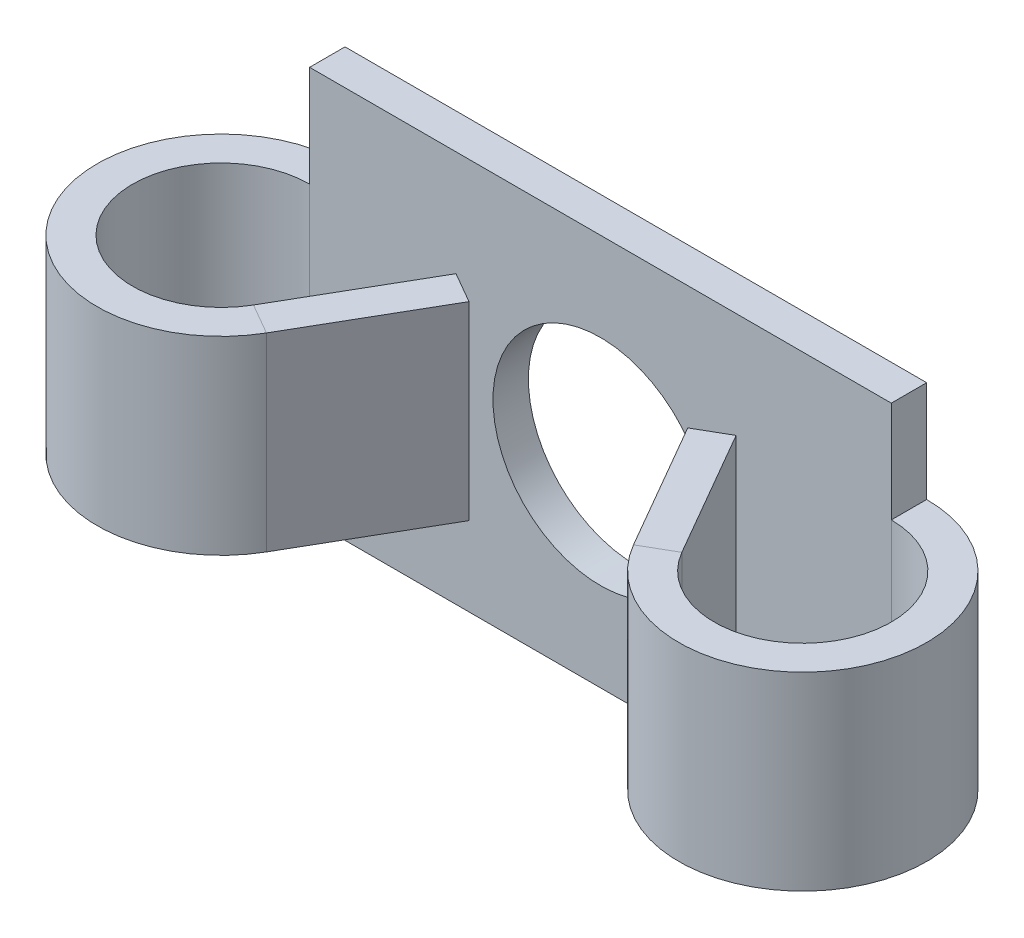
ISO-10303-21;
HEADER;
FILE_DESCRIPTION(('STEP AP214'),'2;1');
FILE_NAME('part.step','',(''),(''),'','','');
FILE_SCHEMA(('AUTOMOTIVE_DESIGN { 1 0 10303 214 1 1 1 1 }'));
ENDSEC;
DATA;
#1=APPLICATION_CONTEXT('core data for automotive mechanical design processes');
#2=APPLICATION_PROTOCOL_DEFINITION('international standard','automotive_design',2000,#1);
#3=PRODUCT_CONTEXT('',#1,'mechanical');
#4=PRODUCT('Part','Part','',(#3));
#5=PRODUCT_RELATED_PRODUCT_CATEGORY('part','',(#4));
#6=PRODUCT_DEFINITION_FORMATION('','',#4);
#7=PRODUCT_DEFINITION_CONTEXT('part definition',#1,'design');
#8=PRODUCT_DEFINITION('design','',#6,#7);
#9=PRODUCT_DEFINITION_SHAPE('','',#8);
#10=(LENGTH_UNIT() NAMED_UNIT(*) SI_UNIT(.MILLI.,.METRE.));
#11=(NAMED_UNIT(*) PLANE_ANGLE_UNIT() SI_UNIT($,.RADIAN.));
#12=(NAMED_UNIT(*) SI_UNIT($,.STERADIAN.) SOLID_ANGLE_UNIT());
#13=UNCERTAINTY_MEASURE_WITH_UNIT(LENGTH_MEASURE(1.E-05),#10,'distance_accuracy_value','');
#14=(GEOMETRIC_REPRESENTATION_CONTEXT(3) GLOBAL_UNCERTAINTY_ASSIGNED_CONTEXT((#13)) GLOBAL_UNIT_ASSIGNED_CONTEXT((#10,
#11,#12)) REPRESENTATION_CONTEXT('',''));
#15=CARTESIAN_POINT('',(0.,0.,0.));
#16=DIRECTION('',(0.,0.,1.));
#17=DIRECTION('',(1.,0.,0.));
#18=AXIS2_PLACEMENT_3D('',#15,#16,#17);
#19=CARTESIAN_POINT('',(-4.32538660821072,0.,0.873205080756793));
#20=DIRECTION('',(-0.499999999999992,0.,0.866025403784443));
#21=DIRECTION('',(0.,-1.,0.));
#22=AXIS2_PLACEMENT_3D('',#19,#20,#21);
#23=PLANE('',#22);
#24=DIRECTION('',(0.,1.,0.));
#25=VECTOR('',#24,1.);
#26=CARTESIAN_POINT('',(-5.53782217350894,0.,0.173205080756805));
#27=LINE('',#26,#25);
#28=CARTESIAN_POINT('',(-5.53782217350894,3.75,0.173205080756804));
#29=VERTEX_POINT('',#28);
#30=CARTESIAN_POINT('',(-5.53782217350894,-3.75,0.173205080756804));
#31=VERTEX_POINT('',#30);
#32=EDGE_CURVE('E270',#29,#31,#27,.F.);
#33=ORIENTED_EDGE('',*,*,#32,.F.);
#34=DIRECTION('',(-0.866025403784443,0.,-0.499999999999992));
#35=VECTOR('',#34,1.);
#36=CARTESIAN_POINT('',(-5.53782217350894,3.75,0.173205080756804));
#37=LINE('',#36,#35);
#38=CARTESIAN_POINT('',(-4.32538660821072,3.75,0.873205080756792));
#39=VERTEX_POINT('',#38);
#40=EDGE_CURVE('E290',#29,#39,#37,.F.);
#41=ORIENTED_EDGE('',*,*,#40,.T.);
#42=DIRECTION('',(0.,-1.,0.));
#43=VECTOR('',#42,1.);
#44=CARTESIAN_POINT('',(-4.32538660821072,0.,0.873205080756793));
#45=LINE('',#44,#43);
#46=CARTESIAN_POINT('',(-4.32538660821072,-3.75,0.873205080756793));
#47=VERTEX_POINT('',#46);
#48=EDGE_CURVE('E264',#39,#47,#45,.T.);
#49=ORIENTED_EDGE('',*,*,#48,.T.);
#50=DIRECTION('',(0.866025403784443,0.,0.499999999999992));
#51=VECTOR('',#50,1.);
#52=CARTESIAN_POINT('',(-4.32538660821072,-3.75,0.873205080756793));
#53=LINE('',#52,#51);
#54=EDGE_CURVE('E227',#47,#31,#53,.F.);
#55=ORIENTED_EDGE('',*,*,#54,.T.);
#56=EDGE_LOOP('',(#33,#41,#49,#55));
#57=FACE_BOUND('',#56,.T.);
#58=ADVANCED_FACE('F36',(#57),#23,.F.);
#59=CARTESIAN_POINT('',(-5.79093106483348,0.,3.41160254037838));
#60=DIRECTION('',(0.866025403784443,0.,0.499999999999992));
#61=DIRECTION('',(0.499999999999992,0.,-0.866025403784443));
#62=AXIS2_PLACEMENT_3D('',#59,#60,#61);
#63=PLANE('',#62);
#64=ORIENTED_EDGE('',*,*,#48,.F.);
#65=DIRECTION('',(0.499999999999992,0.,-0.866025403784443));
#66=VECTOR('',#65,1.);
#67=CARTESIAN_POINT('',(-5.79093106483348,3.75,3.41160254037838));
#68=LINE('',#67,#66);
#69=CARTESIAN_POINT('',(-7.25647552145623,3.75,5.94999999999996));
#70=VERTEX_POINT('',#69);
#71=EDGE_CURVE('E627',#70,#39,#68,.T.);
#72=ORIENTED_EDGE('',*,*,#71,.F.);
#73=DIRECTION('',(0.,1.,0.));
#74=VECTOR('',#73,1.);
#75=CARTESIAN_POINT('',(-7.25647552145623,0.,5.94999999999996));
#76=LINE('',#75,#74);
#77=CARTESIAN_POINT('',(-7.25647552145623,-3.75,5.94999999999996));
#78=VERTEX_POINT('',#77);
#79=EDGE_CURVE('E267',#78,#70,#76,.T.);
#80=ORIENTED_EDGE('',*,*,#79,.F.);
#81=DIRECTION('',(-0.499999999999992,0.,0.866025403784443));
#82=VECTOR('',#81,1.);
#83=CARTESIAN_POINT('',(-5.79093106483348,-3.75,3.41160254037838));
#84=LINE('',#83,#82);
#85=EDGE_CURVE('E221',#47,#78,#84,.T.);
#86=ORIENTED_EDGE('',*,*,#85,.F.);
#87=EDGE_LOOP('',(#64,#72,#80,#86));
#88=FACE_BOUND('',#87,.T.);
#89=ADVANCED_FACE('F344',(#88),#63,.T.);
#90=CARTESIAN_POINT('',(-7.0033666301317,0.,2.71160254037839));
#91=DIRECTION('',(0.866025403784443,0.,0.499999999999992));
#92=DIRECTION('',(0.499999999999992,0.,-0.866025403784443));
#93=AXIS2_PLACEMENT_3D('',#90,#91,#92);
#94=PLANE('',#93);
#95=DIRECTION('',(0.499999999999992,0.,-0.866025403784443));
#96=VECTOR('',#95,1.);
#97=CARTESIAN_POINT('',(-7.0033666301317,3.75,2.71160254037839));
#98=LINE('',#97,#96);
#99=CARTESIAN_POINT('',(-8.46891108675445,3.75,5.24999999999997));
#100=VERTEX_POINT('',#99);
#101=EDGE_CURVE('E622',#100,#29,#98,.T.);
#102=ORIENTED_EDGE('',*,*,#101,.T.);
#103=ORIENTED_EDGE('',*,*,#32,.T.);
#104=DIRECTION('',(0.499999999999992,0.,-0.866025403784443));
#105=VECTOR('',#104,1.);
#106=CARTESIAN_POINT('',(-7.0033666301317,-3.75,2.71160254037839));
#107=LINE('',#106,#105);
#108=CARTESIAN_POINT('',(-8.46891108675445,-3.75,5.24999999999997));
#109=VERTEX_POINT('',#108);
#110=EDGE_CURVE('E224',#31,#109,#107,.F.);
#111=ORIENTED_EDGE('',*,*,#110,.T.);
#112=DIRECTION('',(0.,1.,0.));
#113=VECTOR('',#112,1.);
#114=CARTESIAN_POINT('',(-8.46891108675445,0.,5.24999999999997));
#115=LINE('',#114,#113);
#116=EDGE_CURVE('E257',#109,#100,#115,.T.);
#117=ORIENTED_EDGE('',*,*,#116,.T.);
#118=EDGE_LOOP('',(#102,#103,#111,#117));
#119=FACE_BOUND('',#118,.T.);
#120=ADVANCED_FACE('F350',(#119),#94,.F.);
#121=CARTESIAN_POINT('',(-11.5,-7.75,3.5));
#122=DIRECTION('',(0.,-1.,0.));
#123=DIRECTION('',(0.866025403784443,0.,0.499999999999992));
#124=AXIS2_PLACEMENT_3D('',#121,#122,#123);
#125=CYLINDRICAL_SURFACE('',#124,4.9);
#126=ORIENTED_EDGE('',*,*,#79,.T.);
#127=CARTESIAN_POINT('',(-11.5,3.75,3.5));
#128=DIRECTION('',(0.,-1.,0.));
#129=DIRECTION('',(1.,0.,0.));
#130=AXIS2_PLACEMENT_3D('',#127,#128,#129);
#131=CIRCLE('',#130,4.9);
#132=CARTESIAN_POINT('',(-11.5,3.75,-1.4));
#133=VERTEX_POINT('',#132);
#134=EDGE_CURVE('E638',#133,#70,#131,.F.);
#135=ORIENTED_EDGE('',*,*,#134,.F.);
#136=DIRECTION('',(0.,-1.,0.));
#137=VECTOR('',#136,1.);
#138=CARTESIAN_POINT('',(-11.5,7.75,-1.4));
#139=LINE('',#138,#137);
#140=CARTESIAN_POINT('',(-11.5,-3.75,-1.4));
#141=VERTEX_POINT('',#140);
#142=EDGE_CURVE('E167',#133,#141,#139,.T.);
#143=ORIENTED_EDGE('',*,*,#142,.T.);
#144=CARTESIAN_POINT('',(-11.5,-3.75,3.5));
#145=DIRECTION('',(0.,1.,0.));
#146=DIRECTION('',(-1.,0.,0.));
#147=AXIS2_PLACEMENT_3D('',#144,#145,#146);
#148=CIRCLE('',#147,4.9);
#149=EDGE_CURVE('E217',#78,#141,#148,.F.);
#150=ORIENTED_EDGE('',*,*,#149,.F.);
#151=EDGE_LOOP('',(#126,#135,#143,#150));
#152=FACE_BOUND('',#151,.T.);
#153=ADVANCED_FACE('F556',(#152),#125,.T.);
#154=CARTESIAN_POINT('',(-11.5,-7.75,3.5));
#155=DIRECTION('',(0.,-1.,0.));
#156=DIRECTION('',(0.866025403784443,0.,0.499999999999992));
#157=AXIS2_PLACEMENT_3D('',#154,#155,#156);
#158=CYLINDRICAL_SURFACE('',#157,3.5);
#159=CARTESIAN_POINT('',(-11.5,3.75,3.5));
#160=DIRECTION('',(0.,-1.,0.));
#161=DIRECTION('',(0.,0.,-1.));
#162=AXIS2_PLACEMENT_3D('',#159,#160,#161);
#163=CIRCLE('',#162,3.5);
#164=CARTESIAN_POINT('',(-11.5,3.75,0.));
#165=VERTEX_POINT('',#164);
#166=EDGE_CURVE('E628',#165,#100,#163,.F.);
#167=ORIENTED_EDGE('',*,*,#166,.T.);
#168=ORIENTED_EDGE('',*,*,#116,.F.);
#169=CARTESIAN_POINT('',(-11.5,-3.75,3.5));
#170=DIRECTION('',(0.,-1.,0.));
#171=DIRECTION('',(0.,0.,-1.));
#172=AXIS2_PLACEMENT_3D('',#169,#170,#171);
#173=CIRCLE('',#172,3.5);
#174=CARTESIAN_POINT('',(-11.5,-3.75,0.));
#175=VERTEX_POINT('',#174);
#176=EDGE_CURVE('E218',#109,#175,#173,.T.);
#177=ORIENTED_EDGE('',*,*,#176,.T.);
#178=DIRECTION('',(0.,-1.,0.));
#179=VECTOR('',#178,1.);
#180=CARTESIAN_POINT('',(-11.5,7.75,0.));
#181=LINE('',#180,#179);
#182=EDGE_CURVE('E180',#165,#175,#181,.T.);
#183=ORIENTED_EDGE('',*,*,#182,.F.);
#184=EDGE_LOOP('',(#167,#168,#177,#183));
#185=FACE_BOUND('',#184,.T.);
#186=ADVANCED_FACE('F340',(#185),#158,.F.);
#187=CARTESIAN_POINT('',(4.32538660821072,0.,0.873205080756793));
#188=DIRECTION('',(0.499999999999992,0.,0.866025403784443));
#189=DIRECTION('',(0.,1.,0.));
#190=AXIS2_PLACEMENT_3D('',#187,#188,#189);
#191=PLANE('',#190);
#192=DIRECTION('',(0.,1.,0.));
#193=VECTOR('',#192,1.);
#194=CARTESIAN_POINT('',(4.32538660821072,0.,0.873205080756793));
#195=LINE('',#194,#193);
#196=CARTESIAN_POINT('',(4.32538660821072,-3.75,0.873205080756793));
#197=VERTEX_POINT('',#196);
#198=CARTESIAN_POINT('',(4.32538660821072,3.75,0.873205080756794));
#199=VERTEX_POINT('',#198);
#200=EDGE_CURVE('E254',#197,#199,#195,.T.);
#201=ORIENTED_EDGE('',*,*,#200,.T.);
#202=DIRECTION('',(-0.866025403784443,0.,0.499999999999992));
#203=VECTOR('',#202,1.);
#204=CARTESIAN_POINT('',(4.32538660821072,3.75,0.873205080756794));
#205=LINE('',#204,#203);
#206=CARTESIAN_POINT('',(5.53782217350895,3.75,0.173205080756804));
#207=VERTEX_POINT('',#206);
#208=EDGE_CURVE('E212',#199,#207,#205,.F.);
#209=ORIENTED_EDGE('',*,*,#208,.T.);
#210=DIRECTION('',(0.,1.,0.));
#211=VECTOR('',#210,1.);
#212=CARTESIAN_POINT('',(5.53782217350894,0.,0.173205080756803));
#213=LINE('',#212,#211);
#214=CARTESIAN_POINT('',(5.53782217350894,-3.75,0.173205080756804));
#215=VERTEX_POINT('',#214);
#216=EDGE_CURVE('E260',#215,#207,#213,.T.);
#217=ORIENTED_EDGE('',*,*,#216,.F.);
#218=DIRECTION('',(0.866025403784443,0.,-0.499999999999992));
#219=VECTOR('',#218,1.);
#220=CARTESIAN_POINT('',(5.53782217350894,-3.75,0.173205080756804));
#221=LINE('',#220,#219);
#222=EDGE_CURVE('E248',#215,#197,#221,.F.);
#223=ORIENTED_EDGE('',*,*,#222,.T.);
#224=EDGE_LOOP('',(#201,#209,#217,#223));
#225=FACE_BOUND('',#224,.T.);
#226=ADVANCED_FACE('F308',(#225),#191,.F.);
#227=CARTESIAN_POINT('',(5.79093106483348,0.,3.41160254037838));
#228=DIRECTION('',(-0.866025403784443,0.,0.499999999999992));
#229=DIRECTION('',(0.499999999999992,0.,0.866025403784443));
#230=AXIS2_PLACEMENT_3D('',#227,#228,#229);
#231=PLANE('',#230);
#232=DIRECTION('',(0.,-1.,0.));
#233=VECTOR('',#232,1.);
#234=CARTESIAN_POINT('',(7.25647552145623,0.,5.94999999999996));
#235=LINE('',#234,#233);
#236=CARTESIAN_POINT('',(7.25647552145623,3.75,5.94999999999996));
#237=VERTEX_POINT('',#236);
#238=CARTESIAN_POINT('',(7.25647552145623,-3.75,5.94999999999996));
#239=VERTEX_POINT('',#238);
#240=EDGE_CURVE('E258',#237,#239,#235,.T.);
#241=ORIENTED_EDGE('',*,*,#240,.F.);
#242=DIRECTION('',(0.499999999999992,0.,0.866025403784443));
#243=VECTOR('',#242,1.);
#244=CARTESIAN_POINT('',(5.79093106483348,3.75,3.41160254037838));
#245=LINE('',#244,#243);
#246=EDGE_CURVE('E299',#199,#237,#245,.T.);
#247=ORIENTED_EDGE('',*,*,#246,.F.);
#248=ORIENTED_EDGE('',*,*,#200,.F.);
#249=DIRECTION('',(0.499999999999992,0.,0.866025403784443));
#250=VECTOR('',#249,1.);
#251=CARTESIAN_POINT('',(5.79093106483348,-3.75,3.41160254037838));
#252=LINE('',#251,#250);
#253=EDGE_CURVE('E243',#239,#197,#252,.F.);
#254=ORIENTED_EDGE('',*,*,#253,.F.);
#255=EDGE_LOOP('',(#241,#247,#248,#254));
#256=FACE_BOUND('',#255,.T.);
#257=ADVANCED_FACE('F332',(#256),#231,.T.);
#258=CARTESIAN_POINT('',(7.0033666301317,0.,2.71160254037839));
#259=DIRECTION('',(-0.866025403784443,0.,0.499999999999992));
#260=DIRECTION('',(0.499999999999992,0.,0.866025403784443));
#261=AXIS2_PLACEMENT_3D('',#258,#259,#260);
#262=PLANE('',#261);
#263=DIRECTION('',(0.499999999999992,0.,0.866025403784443));
#264=VECTOR('',#263,1.);
#265=CARTESIAN_POINT('',(7.0033666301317,3.75,2.71160254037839));
#266=LINE('',#265,#264);
#267=CARTESIAN_POINT('',(8.46891108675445,3.75,5.24999999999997));
#268=VERTEX_POINT('',#267);
#269=EDGE_CURVE('E301',#207,#268,#266,.T.);
#270=ORIENTED_EDGE('',*,*,#269,.T.);
#271=DIRECTION('',(0.,1.,0.));
#272=VECTOR('',#271,1.);
#273=CARTESIAN_POINT('',(8.46891108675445,0.,5.24999999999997));
#274=LINE('',#273,#272);
#275=CARTESIAN_POINT('',(8.46891108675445,-3.75,5.24999999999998));
#276=VERTEX_POINT('',#275);
#277=EDGE_CURVE('E251',#268,#276,#274,.F.);
#278=ORIENTED_EDGE('',*,*,#277,.T.);
#279=DIRECTION('',(-0.499999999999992,0.,-0.866025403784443));
#280=VECTOR('',#279,1.);
#281=CARTESIAN_POINT('',(7.0033666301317,-3.75,2.71160254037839));
#282=LINE('',#281,#280);
#283=EDGE_CURVE('E240',#276,#215,#282,.T.);
#284=ORIENTED_EDGE('',*,*,#283,.T.);
#285=ORIENTED_EDGE('',*,*,#216,.T.);
#286=EDGE_LOOP('',(#270,#278,#284,#285));
#287=FACE_BOUND('',#286,.T.);
#288=ADVANCED_FACE('F313',(#287),#262,.F.);
#289=CARTESIAN_POINT('',(11.5,7.75,3.5));
#290=DIRECTION('',(0.,1.,0.));
#291=DIRECTION('',(-0.866025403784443,0.,0.499999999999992));
#292=AXIS2_PLACEMENT_3D('',#289,#290,#291);
#293=CYLINDRICAL_SURFACE('',#292,4.90000000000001);
#294=DIRECTION('',(0.,1.,0.));
#295=VECTOR('',#294,1.);
#296=CARTESIAN_POINT('',(11.5,7.75,-1.4));
#297=LINE('',#296,#295);
#298=CARTESIAN_POINT('',(11.5,-3.74999999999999,-1.40000000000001));
#299=VERTEX_POINT('',#298);
#300=CARTESIAN_POINT('',(11.5,3.74999999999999,-1.40000000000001));
#301=VERTEX_POINT('',#300);
#302=EDGE_CURVE('E174',#299,#301,#297,.T.);
#303=ORIENTED_EDGE('',*,*,#302,.T.);
#304=CARTESIAN_POINT('',(11.5,3.74999999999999,3.5));
#305=DIRECTION('',(0.,-1.,0.));
#306=DIRECTION('',(1.,0.,0.));
#307=AXIS2_PLACEMENT_3D('',#304,#305,#306);
#308=CIRCLE('',#307,4.90000000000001);
#309=EDGE_CURVE('E284',#237,#301,#308,.F.);
#310=ORIENTED_EDGE('',*,*,#309,.F.);
#311=ORIENTED_EDGE('',*,*,#240,.T.);
#312=CARTESIAN_POINT('',(11.5,-3.74999999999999,3.5));
#313=DIRECTION('',(0.,1.,0.));
#314=DIRECTION('',(-1.,0.,0.));
#315=AXIS2_PLACEMENT_3D('',#312,#313,#314);
#316=CIRCLE('',#315,4.90000000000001);
#317=EDGE_CURVE('E236',#299,#239,#316,.F.);
#318=ORIENTED_EDGE('',*,*,#317,.F.);
#319=EDGE_LOOP('',(#303,#310,#311,#318));
#320=FACE_BOUND('',#319,.T.);
#321=ADVANCED_FACE('F283',(#320),#293,.T.);
#322=CARTESIAN_POINT('',(11.5,7.75,3.5));
#323=DIRECTION('',(0.,1.,0.));
#324=DIRECTION('',(-0.866025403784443,0.,0.499999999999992));
#325=AXIS2_PLACEMENT_3D('',#322,#323,#324);
#326=CYLINDRICAL_SURFACE('',#325,3.50000000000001);
#327=CARTESIAN_POINT('',(11.5,3.75,3.5));
#328=DIRECTION('',(0.,1.,0.));
#329=DIRECTION('',(-1.,0.,0.));
#330=AXIS2_PLACEMENT_3D('',#327,#328,#329);
#331=CIRCLE('',#330,3.50000000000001);
#332=CARTESIAN_POINT('',(11.5,3.74999999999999,0.));
#333=VERTEX_POINT('',#332);
#334=EDGE_CURVE('E296',#268,#333,#331,.T.);
#335=ORIENTED_EDGE('',*,*,#334,.T.);
#336=DIRECTION('',(0.,1.,0.));
#337=VECTOR('',#336,1.);
#338=CARTESIAN_POINT('',(11.5,7.75,0.));
#339=LINE('',#338,#337);
#340=CARTESIAN_POINT('',(11.5,-3.74999999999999,0.));
#341=VERTEX_POINT('',#340);
#342=EDGE_CURVE('E183',#341,#333,#339,.T.);
#343=ORIENTED_EDGE('',*,*,#342,.F.);
#344=CARTESIAN_POINT('',(11.5,-3.74999999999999,3.5));
#345=DIRECTION('',(0.,1.,0.));
#346=DIRECTION('',(-1.,0.,0.));
#347=AXIS2_PLACEMENT_3D('',#344,#345,#346);
#348=CIRCLE('',#347,3.50000000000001);
#349=EDGE_CURVE('E237',#341,#276,#348,.F.);
#350=ORIENTED_EDGE('',*,*,#349,.T.);
#351=ORIENTED_EDGE('',*,*,#277,.F.);
#352=EDGE_LOOP('',(#335,#343,#350,#351));
#353=FACE_BOUND('',#352,.T.);
#354=ADVANCED_FACE('F324',(#353),#326,.F.);
#355=CARTESIAN_POINT('',(-11.5,7.75,-1.4));
#356=DIRECTION('',(0.,1.,0.));
#357=DIRECTION('',(-1.,0.,0.));
#358=AXIS2_PLACEMENT_3D('',#355,#356,#357);
#359=PLANE('',#358);
#360=DIRECTION('',(-1.,0.,0.));
#361=VECTOR('',#360,1.);
#362=CARTESIAN_POINT('',(-11.5,7.75,0.));
#363=LINE('',#362,#361);
#364=CARTESIAN_POINT('',(11.5,7.75,0.));
#365=VERTEX_POINT('',#364);
#366=CARTESIAN_POINT('',(-11.5,7.75,0.));
#367=VERTEX_POINT('',#366);
#368=EDGE_CURVE('E187',#365,#367,#363,.T.);
#369=ORIENTED_EDGE('',*,*,#368,.F.);
#370=DIRECTION('',(0.,0.,1.));
#371=VECTOR('',#370,1.);
#372=CARTESIAN_POINT('',(11.5,7.75,-1.4));
#373=LINE('',#372,#371);
#374=CARTESIAN_POINT('',(11.5,7.75,-1.4));
#375=VERTEX_POINT('',#374);
#376=EDGE_CURVE('E45',#375,#365,#373,.T.);
#377=ORIENTED_EDGE('',*,*,#376,.F.);
#378=DIRECTION('',(-1.,0.,0.));
#379=VECTOR('',#378,1.);
#380=CARTESIAN_POINT('',(-11.5,7.75,-1.4));
#381=LINE('',#380,#379);
#382=CARTESIAN_POINT('',(-11.5,7.75,-1.4));
#383=VERTEX_POINT('',#382);
#384=EDGE_CURVE('E165',#375,#383,#381,.T.);
#385=ORIENTED_EDGE('',*,*,#384,.T.);
#386=DIRECTION('',(0.,0.,1.));
#387=VECTOR('',#386,1.);
#388=CARTESIAN_POINT('',(-11.5,7.75,-1.4));
#389=LINE('',#388,#387);
#390=EDGE_CURVE('E11',#383,#367,#389,.T.);
#391=ORIENTED_EDGE('',*,*,#390,.T.);
#392=EDGE_LOOP('',(#369,#377,#385,#391));
#393=FACE_BOUND('',#392,.T.);
#394=ADVANCED_FACE('F170',(#393),#359,.T.);
#395=CARTESIAN_POINT('',(-11.5,-7.75,-1.4));
#396=DIRECTION('',(0.,-1.,0.));
#397=DIRECTION('',(0.,0.,-1.));
#398=AXIS2_PLACEMENT_3D('',#395,#396,#397);
#399=PLANE('',#398);
#400=DIRECTION('',(1.,0.,0.));
#401=VECTOR('',#400,1.);
#402=CARTESIAN_POINT('',(-11.5,-7.75,0.));
#403=LINE('',#402,#401);
#404=CARTESIAN_POINT('',(-11.5,-7.75,0.));
#405=VERTEX_POINT('',#404);
#406=CARTESIAN_POINT('',(11.5,-7.75,0.));
#407=VERTEX_POINT('',#406);
#408=EDGE_CURVE('E179',#405,#407,#403,.T.);
#409=ORIENTED_EDGE('',*,*,#408,.F.);
#410=DIRECTION('',(0.,0.,1.));
#411=VECTOR('',#410,1.);
#412=CARTESIAN_POINT('',(-11.5,-7.75,-1.4));
#413=LINE('',#412,#411);
#414=CARTESIAN_POINT('',(-11.5,-7.75,-1.4));
#415=VERTEX_POINT('',#414);
#416=EDGE_CURVE('E40',#415,#405,#413,.T.);
#417=ORIENTED_EDGE('',*,*,#416,.F.);
#418=DIRECTION('',(1.,0.,0.));
#419=VECTOR('',#418,1.);
#420=CARTESIAN_POINT('',(-11.5,-7.75,-1.4));
#421=LINE('',#420,#419);
#422=CARTESIAN_POINT('',(11.5,-7.75,-1.40000000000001));
#423=VERTEX_POINT('',#422);
#424=EDGE_CURVE('E168',#415,#423,#421,.T.);
#425=ORIENTED_EDGE('',*,*,#424,.T.);
#426=DIRECTION('',(0.,0.,1.));
#427=VECTOR('',#426,1.);
#428=CARTESIAN_POINT('',(11.5,-7.75,-1.4));
#429=LINE('',#428,#427);
#430=EDGE_CURVE('E173',#423,#407,#429,.T.);
#431=ORIENTED_EDGE('',*,*,#430,.T.);
#432=EDGE_LOOP('',(#409,#417,#425,#431));
#433=FACE_BOUND('',#432,.T.);
#434=ADVANCED_FACE('F38',(#433),#399,.T.);
#435=CARTESIAN_POINT('',(0.,0.,-1.4));
#436=DIRECTION('',(0.,0.,1.));
#437=DIRECTION('',(1.,0.,0.));
#438=AXIS2_PLACEMENT_3D('',#435,#436,#437);
#439=PLANE('',#438);
#440=CARTESIAN_POINT('',(0.,0.,-1.4));
#441=DIRECTION('',(0.,0.,1.));
#442=DIRECTION('',(1.,0.,0.));
#443=AXIS2_PLACEMENT_3D('',#440,#441,#442);
#444=CIRCLE('',#443,4.25);
#445=CARTESIAN_POINT('',(4.25,0.,-1.4));
#446=VERTEX_POINT('',#445);
#447=EDGE_CURVE('E274',#446,#446,#444,.T.);
#448=ORIENTED_EDGE('',*,*,#447,.T.);
#449=EDGE_LOOP('',(#448));
#450=FACE_BOUND('',#449,.T.);
#451=EDGE_CURVE('E153',#383,#133,#139,.T.);
#452=ORIENTED_EDGE('',*,*,#451,.F.);
#453=ORIENTED_EDGE('',*,*,#384,.F.);
#454=DIRECTION('',(0.,1.,0.));
#455=VECTOR('',#454,1.);
#456=CARTESIAN_POINT('',(11.5,7.75,-1.4));
#457=LINE('',#456,#455);
#458=EDGE_CURVE('E62',#375,#301,#457,.F.);
#459=ORIENTED_EDGE('',*,*,#458,.T.);
#460=ORIENTED_EDGE('',*,*,#302,.F.);
#461=EDGE_CURVE('E171',#423,#299,#297,.T.);
#462=ORIENTED_EDGE('',*,*,#461,.F.);
#463=ORIENTED_EDGE('',*,*,#424,.F.);
#464=DIRECTION('',(0.,-1.,0.));
#465=VECTOR('',#464,1.);
#466=CARTESIAN_POINT('',(-11.5,-7.75,-1.4));
#467=LINE('',#466,#465);
#468=EDGE_CURVE('E206',#415,#141,#467,.F.);
#469=ORIENTED_EDGE('',*,*,#468,.T.);
#470=ORIENTED_EDGE('',*,*,#142,.F.);
#471=EDGE_LOOP('',(#452,#453,#459,#460,#462,#463,#469,#470));
#472=FACE_BOUND('',#471,.T.);
#473=ADVANCED_FACE('F164',(#450,#472),#439,.F.);
#474=CARTESIAN_POINT('',(0.,0.,0.));
#475=DIRECTION('',(0.,0.,1.));
#476=DIRECTION('',(1.,0.,0.));
#477=AXIS2_PLACEMENT_3D('',#474,#475,#476);
#478=PLANE('',#477);
#479=CARTESIAN_POINT('',(0.,0.,0.));
#480=DIRECTION('',(0.,0.,1.));
#481=DIRECTION('',(1.,0.,0.));
#482=AXIS2_PLACEMENT_3D('',#479,#480,#481);
#483=CIRCLE('',#482,4.25);
#484=CARTESIAN_POINT('',(4.25,0.,0.));
#485=VERTEX_POINT('',#484);
#486=EDGE_CURVE('E266',#485,#485,#483,.T.);
#487=ORIENTED_EDGE('',*,*,#486,.F.);
#488=EDGE_LOOP('',(#487));
#489=FACE_BOUND('',#488,.T.);
#490=EDGE_CURVE('E156',#367,#165,#181,.T.);
#491=ORIENTED_EDGE('',*,*,#490,.T.);
#492=ORIENTED_EDGE('',*,*,#182,.T.);
#493=DIRECTION('',(0.,-1.,0.));
#494=VECTOR('',#493,1.);
#495=CARTESIAN_POINT('',(-11.5,-7.75,0.));
#496=LINE('',#495,#494);
#497=EDGE_CURVE('E201',#405,#175,#496,.F.);
#498=ORIENTED_EDGE('',*,*,#497,.F.);
#499=ORIENTED_EDGE('',*,*,#408,.T.);
#500=EDGE_CURVE('E184',#407,#341,#339,.T.);
#501=ORIENTED_EDGE('',*,*,#500,.T.);
#502=ORIENTED_EDGE('',*,*,#342,.T.);
#503=DIRECTION('',(0.,1.,0.));
#504=VECTOR('',#503,1.);
#505=CARTESIAN_POINT('',(11.5,7.75,0.));
#506=LINE('',#505,#504);
#507=EDGE_CURVE('E287',#365,#333,#506,.F.);
#508=ORIENTED_EDGE('',*,*,#507,.F.);
#509=ORIENTED_EDGE('',*,*,#368,.T.);
#510=EDGE_LOOP('',(#491,#492,#498,#499,#501,#502,#508,#509));
#511=FACE_BOUND('',#510,.T.);
#512=ADVANCED_FACE('F198',(#489,#511),#478,.T.);
#513=CARTESIAN_POINT('',(0.,0.,-1.4));
#514=DIRECTION('',(0.,0.,1.));
#515=DIRECTION('',(1.,0.,0.));
#516=AXIS2_PLACEMENT_3D('',#513,#514,#515);
#517=CYLINDRICAL_SURFACE('',#516,4.25);
#518=ORIENTED_EDGE('',*,*,#447,.F.);
#519=EDGE_LOOP('',(#518));
#520=FACE_BOUND('',#519,.T.);
#521=ORIENTED_EDGE('',*,*,#486,.T.);
#522=EDGE_LOOP('',(#521));
#523=FACE_BOUND('',#522,.T.);
#524=ADVANCED_FACE('F356',(#520,#523),#517,.F.);
#525=CARTESIAN_POINT('',(7.0033666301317,-3.75,2.71160254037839));
#526=DIRECTION('',(0.,1.,0.));
#527=DIRECTION('',(-0.499999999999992,0.,-0.866025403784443));
#528=AXIS2_PLACEMENT_3D('',#525,#526,#527);
#529=PLANE('',#528);
#530=ORIENTED_EDGE('',*,*,#222,.F.);
#531=ORIENTED_EDGE('',*,*,#283,.F.);
#532=DIRECTION('',(0.866025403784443,0.,-0.499999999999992));
#533=VECTOR('',#532,1.);
#534=CARTESIAN_POINT('',(8.46891108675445,-3.75,5.24999999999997));
#535=LINE('',#534,#533);
#536=EDGE_CURVE('E245',#276,#239,#535,.F.);
#537=ORIENTED_EDGE('',*,*,#536,.T.);
#538=ORIENTED_EDGE('',*,*,#253,.T.);
#539=EDGE_LOOP('',(#530,#531,#537,#538));
#540=FACE_BOUND('',#539,.T.);
#541=ADVANCED_FACE('F318',(#540),#529,.F.);
#542=CARTESIAN_POINT('',(11.5,-3.74999999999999,3.5));
#543=DIRECTION('',(0.,-1.,0.));
#544=DIRECTION('',(1.,0.,0.));
#545=AXIS2_PLACEMENT_3D('',#542,#543,#544);
#546=PLANE('',#545);
#547=ORIENTED_EDGE('',*,*,#317,.T.);
#548=ORIENTED_EDGE('',*,*,#536,.F.);
#549=ORIENTED_EDGE('',*,*,#349,.F.);
#550=DIRECTION('',(0.,0.,1.));
#551=VECTOR('',#550,1.);
#552=CARTESIAN_POINT('',(11.5,-3.74999999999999,0.));
#553=LINE('',#552,#551);
#554=EDGE_CURVE('E53',#341,#299,#553,.F.);
#555=ORIENTED_EDGE('',*,*,#554,.T.);
#556=EDGE_LOOP('',(#547,#548,#549,#555));
#557=FACE_BOUND('',#556,.T.);
#558=ADVANCED_FACE('F321',(#557),#546,.T.);
#559=CARTESIAN_POINT('',(11.5,-5.75,0.));
#560=DIRECTION('',(-1.,0.,0.));
#561=DIRECTION('',(0.,1.,0.));
#562=AXIS2_PLACEMENT_3D('',#559,#560,#561);
#563=PLANE('',#562);
#564=ORIENTED_EDGE('',*,*,#500,.F.);
#565=ORIENTED_EDGE('',*,*,#430,.F.);
#566=ORIENTED_EDGE('',*,*,#461,.T.);
#567=ORIENTED_EDGE('',*,*,#554,.F.);
#568=EDGE_LOOP('',(#564,#565,#566,#567));
#569=FACE_BOUND('',#568,.T.);
#570=ADVANCED_FACE('F379',(#569),#563,.F.);
#571=CARTESIAN_POINT('',(-5.79093106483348,-3.75,3.41160254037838));
#572=DIRECTION('',(0.,1.,0.));
#573=DIRECTION('',(-0.499999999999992,0.,0.866025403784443));
#574=AXIS2_PLACEMENT_3D('',#571,#572,#573);
#575=PLANE('',#574);
#576=ORIENTED_EDGE('',*,*,#85,.T.);
#577=DIRECTION('',(0.866025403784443,0.,0.499999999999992));
#578=VECTOR('',#577,1.);
#579=CARTESIAN_POINT('',(-7.25647552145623,-3.75,5.94999999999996));
#580=LINE('',#579,#578);
#581=EDGE_CURVE('E230',#78,#109,#580,.F.);
#582=ORIENTED_EDGE('',*,*,#581,.T.);
#583=ORIENTED_EDGE('',*,*,#110,.F.);
#584=ORIENTED_EDGE('',*,*,#54,.F.);
#585=EDGE_LOOP('',(#576,#582,#583,#584));
#586=FACE_BOUND('',#585,.T.);
#587=ADVANCED_FACE('F382',(#586),#575,.F.);
#588=CARTESIAN_POINT('',(-11.5,-3.75,3.5));
#589=DIRECTION('',(0.,-1.,0.));
#590=DIRECTION('',(1.,0.,0.));
#591=AXIS2_PLACEMENT_3D('',#588,#589,#590);
#592=PLANE('',#591);
#593=DIRECTION('',(0.,0.,1.));
#594=VECTOR('',#593,1.);
#595=CARTESIAN_POINT('',(-11.5,-3.75,0.));
#596=LINE('',#595,#594);
#597=EDGE_CURVE('E209',#175,#141,#596,.F.);
#598=ORIENTED_EDGE('',*,*,#597,.F.);
#599=ORIENTED_EDGE('',*,*,#176,.F.);
#600=ORIENTED_EDGE('',*,*,#581,.F.);
#601=ORIENTED_EDGE('',*,*,#149,.T.);
#602=EDGE_LOOP('',(#598,#599,#600,#601));
#603=FACE_BOUND('',#602,.T.);
#604=ADVANCED_FACE('F385',(#603),#592,.T.);
#605=CARTESIAN_POINT('',(-11.5,-5.75,0.));
#606=DIRECTION('',(1.,0.,0.));
#607=DIRECTION('',(0.,-1.,0.));
#608=AXIS2_PLACEMENT_3D('',#605,#606,#607);
#609=PLANE('',#608);
#610=ORIENTED_EDGE('',*,*,#416,.T.);
#611=ORIENTED_EDGE('',*,*,#497,.T.);
#612=ORIENTED_EDGE('',*,*,#597,.T.);
#613=ORIENTED_EDGE('',*,*,#468,.F.);
#614=EDGE_LOOP('',(#610,#611,#612,#613));
#615=FACE_BOUND('',#614,.T.);
#616=ADVANCED_FACE('F389',(#615),#609,.F.);
#617=CARTESIAN_POINT('',(5.79093106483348,3.75,3.41160254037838));
#618=DIRECTION('',(0.,-1.,0.));
#619=DIRECTION('',(0.499999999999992,0.,0.866025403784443));
#620=AXIS2_PLACEMENT_3D('',#617,#618,#619);
#621=PLANE('',#620);
#622=ORIENTED_EDGE('',*,*,#246,.T.);
#623=DIRECTION('',(-0.866025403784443,0.,0.499999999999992));
#624=VECTOR('',#623,1.);
#625=CARTESIAN_POINT('',(7.25647552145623,3.75,5.94999999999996));
#626=LINE('',#625,#624);
#627=EDGE_CURVE('E207',#237,#268,#626,.F.);
#628=ORIENTED_EDGE('',*,*,#627,.T.);
#629=ORIENTED_EDGE('',*,*,#269,.F.);
#630=ORIENTED_EDGE('',*,*,#208,.F.);
#631=EDGE_LOOP('',(#622,#628,#629,#630));
#632=FACE_BOUND('',#631,.T.);
#633=ADVANCED_FACE('F330',(#632),#621,.F.);
#634=CARTESIAN_POINT('',(11.5,3.74999999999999,3.5));
#635=DIRECTION('',(0.,1.,0.));
#636=DIRECTION('',(-1.,0.,0.));
#637=AXIS2_PLACEMENT_3D('',#634,#635,#636);
#638=PLANE('',#637);
#639=ORIENTED_EDGE('',*,*,#309,.T.);
#640=DIRECTION('',(0.,0.,1.));
#641=VECTOR('',#640,1.);
#642=CARTESIAN_POINT('',(11.5,3.74999999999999,0.));
#643=LINE('',#642,#641);
#644=EDGE_CURVE('E286',#333,#301,#643,.F.);
#645=ORIENTED_EDGE('',*,*,#644,.F.);
#646=ORIENTED_EDGE('',*,*,#334,.F.);
#647=ORIENTED_EDGE('',*,*,#627,.F.);
#648=EDGE_LOOP('',(#639,#645,#646,#647));
#649=FACE_BOUND('',#648,.T.);
#650=ADVANCED_FACE('F329',(#649),#638,.T.);
#651=CARTESIAN_POINT('',(11.5,5.75,0.));
#652=DIRECTION('',(-1.,0.,0.));
#653=DIRECTION('',(0.,1.,0.));
#654=AXIS2_PLACEMENT_3D('',#651,#652,#653);
#655=PLANE('',#654);
#656=ORIENTED_EDGE('',*,*,#376,.T.);
#657=ORIENTED_EDGE('',*,*,#507,.T.);
#658=ORIENTED_EDGE('',*,*,#644,.T.);
#659=ORIENTED_EDGE('',*,*,#458,.F.);
#660=EDGE_LOOP('',(#656,#657,#658,#659));
#661=FACE_BOUND('',#660,.T.);
#662=ADVANCED_FACE('F327',(#661),#655,.F.);
#663=CARTESIAN_POINT('',(-7.0033666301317,3.75,2.71160254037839));
#664=DIRECTION('',(0.,-1.,0.));
#665=DIRECTION('',(0.499999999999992,0.,-0.866025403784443));
#666=AXIS2_PLACEMENT_3D('',#663,#664,#665);
#667=PLANE('',#666);
#668=ORIENTED_EDGE('',*,*,#40,.F.);
#669=ORIENTED_EDGE('',*,*,#101,.F.);
#670=DIRECTION('',(-0.866025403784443,0.,-0.499999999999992));
#671=VECTOR('',#670,1.);
#672=CARTESIAN_POINT('',(-8.46891108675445,3.75,5.24999999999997));
#673=LINE('',#672,#671);
#674=EDGE_CURVE('E293',#100,#70,#673,.F.);
#675=ORIENTED_EDGE('',*,*,#674,.T.);
#676=ORIENTED_EDGE('',*,*,#71,.T.);
#677=EDGE_LOOP('',(#668,#669,#675,#676));
#678=FACE_BOUND('',#677,.T.);
#679=ADVANCED_FACE('F399',(#678),#667,.F.);
#680=CARTESIAN_POINT('',(-11.5,3.75,3.5));
#681=DIRECTION('',(0.,1.,0.));
#682=DIRECTION('',(-1.,0.,0.));
#683=AXIS2_PLACEMENT_3D('',#680,#681,#682);
#684=PLANE('',#683);
#685=ORIENTED_EDGE('',*,*,#674,.F.);
#686=ORIENTED_EDGE('',*,*,#166,.F.);
#687=DIRECTION('',(0.,0.,1.));
#688=VECTOR('',#687,1.);
#689=CARTESIAN_POINT('',(-11.5,3.75,0.));
#690=LINE('',#689,#688);
#691=EDGE_CURVE('E641',#165,#133,#690,.F.);
#692=ORIENTED_EDGE('',*,*,#691,.T.);
#693=ORIENTED_EDGE('',*,*,#134,.T.);
#694=EDGE_LOOP('',(#685,#686,#692,#693));
#695=FACE_BOUND('',#694,.T.);
#696=ADVANCED_FACE('F402',(#695),#684,.T.);
#697=CARTESIAN_POINT('',(-11.5,5.75,0.));
#698=DIRECTION('',(1.,0.,0.));
#699=DIRECTION('',(0.,-1.,0.));
#700=AXIS2_PLACEMENT_3D('',#697,#698,#699);
#701=PLANE('',#700);
#702=ORIENTED_EDGE('',*,*,#490,.F.);
#703=ORIENTED_EDGE('',*,*,#390,.F.);
#704=ORIENTED_EDGE('',*,*,#451,.T.);
#705=ORIENTED_EDGE('',*,*,#691,.F.);
#706=EDGE_LOOP('',(#702,#703,#704,#705));
#707=FACE_BOUND('',#706,.T.);
#708=ADVANCED_FACE('F151',(#707),#701,.F.);
#709=CLOSED_SHELL('',(#58,#89,#120,#153,#186,#226,#257,#288,#321,#354,#394,#434,#473,#512,#524,
#541,#558,#570,#587,#604,#616,#633,#650,#662,#679,#696,#708));
#710=MANIFOLD_SOLID_BREP('B2',#709);
#711=ADVANCED_BREP_SHAPE_REPRESENTATION('',(#18,#710),#14);
#712=SHAPE_DEFINITION_REPRESENTATION(#9,#711);
ENDSEC;
END-ISO-10303-21;
